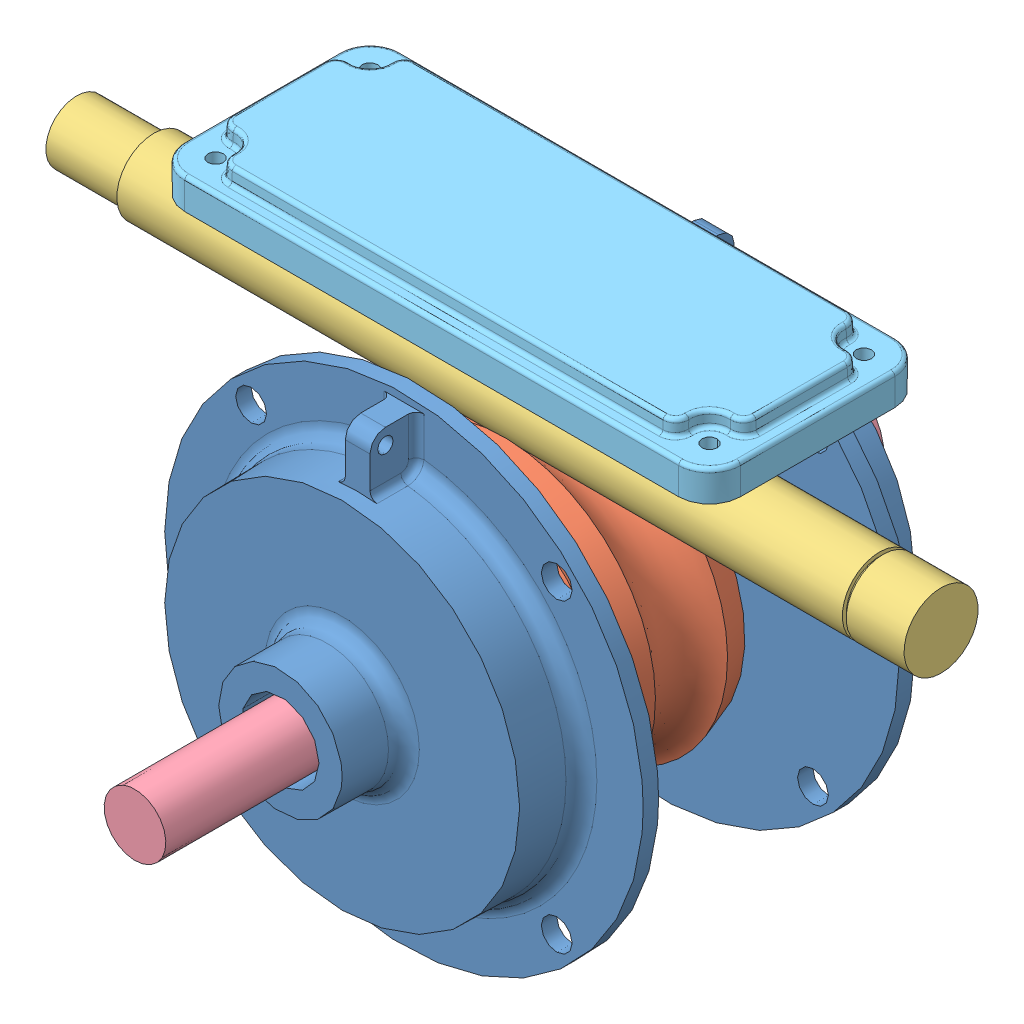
SolidWorks assembly Gearbox Assy_&.SLDASM, configuration Default (file format 15000). Lengths in mm.
Overall size (177.8 130.18 142.95).
7 component instances, 6 part files, 15 mates.
Components (placement in the parent):
- Housing_&-1: Housing_&.SLDPRT [Default] at origin size (139.7 120.65 60.32)
- Cover_Pl&Lug_&-1: Cover_Pl&Lug_&.SLDPRT [Default] at (0 67.31 24.765) size (98.42 98.42 28.57)
- Cover_Pl&Lug_&-2: Cover_Pl&Lug_&.SLDPRT [Default] at (0 67.31 -24.765) x (-1 0 0) z (0 0 -1) size (98.42 98.42 28.57)
- Worm Gear_&-1: Worm Gear_&.SLDPRT [Default] at (0 67.31 0) x (0.988887 0.14867 0) z (0 0 1) size (62.43 62.43 25.4)
- Offset Shaft_&-1: Offset Shaft_&.SLDPRT [Default] at (-95.25 101.6 0) x (1 0 0) z (0 0.117304 0.993096) size (177.8 15.24 15.24)
- Worm Gear Shaft_&-1: Worm Gear Shaft_&.SLDPRT [Default] at (0 67.31 -53.34) x (-0.255356 0.966847 0) z (0 0 1) size (22.23 22.23 142.95)
- Cover Plate_&-1: Cover Plate_&.SLDPRT [Default] at (0 120.65 0) size (114.3 9.53 44.45)
Mates (geometry in assembly coordinates):
- Concentric1: concentric aligned: cylinder of Housing_&-1 through (0 67.31 24.765) axis (0 0 -1) radius 49.2125; cylinder of Cover_Pl&Lug_&-1 through (0 67.31 27.94) axis (0 0 -1) radius 49.2125
- Concentric2: concentric aligned: cylinder of Housing_&-1 through (31.4309 98.7409 -30.1625) axis (0 0 1) radius 3.175; cylinder of Cover_Pl&Lug_&-1 through (31.4309 98.7409 24.765) axis (0 0 1) radius 3.175
- Coincident1: coincident anti-aligned: plane of Housing_&-1 through (0 67.31 24.765) normal (0 0 1); plane of Cover_Pl&Lug_&-1 through (0 67.31 24.765) normal (0 0 -1)
- Concentric3: concentric anti-aligned: cylinder of Cover_Pl&Lug_&-1 through (0 67.31 24.765) axis (0 0 1) radius 7.9375; cylinder of Worm Gear Shaft_&-1 through (0 67.31 83.2612) axis (0 0 -1) radius 6.35
- Coincident2: coincident anti-aligned: plane of Cover_Pl&Lug_&-2 through (0 67.31 -53.34) normal (0 0 -1); plane of Worm Gear Shaft_&-1 through (0 67.31 -53.34) normal (0 0 1)
- Concentric8: concentric aligned: cylinder of Housing_&-1 through (0 67.31 -30.1625) axis (0 0 1) radius 39.6875; cylinder of Cover_Pl&Lug_&-2 through (0 67.31 -40.64) axis (0 0 1) radius 36.5125
- Coincident5: coincident anti-aligned: plane of Housing_&-1 through (0 67.31 -24.765) normal (0 0 -1); plane of Cover_Pl&Lug_&-2 through (0 67.31 -24.765) normal (0 0 1)
- Concentric9: concentric anti-aligned: cylinder of Housing_&-1 through (31.4309 35.8791 -30.1625) axis (0 0 1) radius 3.175; cylinder of Cover_Pl&Lug_&-2 through (31.4309 35.8791 -24.765) axis (0 0 -1) radius 3.175
- Concentric11: concentric aligned: cylinder of Housing_&-1 through (69.85 101.6 0) axis (-1 0 0) radius 7.7343; cylinder of Offset Shaft_&-1 through (82.55 101.6 0) axis (-1 0 0) radius 7.62
- Coincident6: coincident aligned: plane of Housing_&-1 through (69.85 101.6 0) normal (1 0 0); plane of Offset Shaft_&-1 through (69.85 101.6 0) normal (1 0 0)
- Coincident7: coincident anti-aligned: plane of Housing_&-1 through (-57.15 120.65 22.225) normal (0 1 0); plane of Cover Plate_&-1 through (-50.8 120.65 15.875) normal (0 -1 0)
- Coincident8: coincident aligned: plane of Housing_&-1 through (-57.15 120.65 22.225) normal (0 0 1); plane of Cover Plate_&-1 through (50.8 127 22.225) normal (0 0 1)
- Coincident9: coincident aligned: plane of Housing_&-1 through (57.15 120.65 22.225) normal (1 0 0); plane of Cover Plate_&-1 through (57.15 127 15.875) normal (1 0 0)
- Concentric12: concentric anti-aligned: cylinder of Worm Gear_&-1 through (0 67.31 0) axis (0 0 1) radius 7.9375; cylinder of Worm Gear Shaft_&-1 through (0 67.31 7.0612) axis (0 0 -1) radius 7.9121
- Width1: width aligned: plane of Housing_&-1 through (0 67.31 -24.765) normal (0 0 -1); plane of Housing_&-1 through (0 67.31 24.765) normal (0 0 1); plane of Worm Gear_&-1 through (-3.7762 92.4277 -12.7) normal (0 0 -1); plane of Worm Gear_&-1 through (-3.7762 92.4277 12.7) normal (0 0 1)
